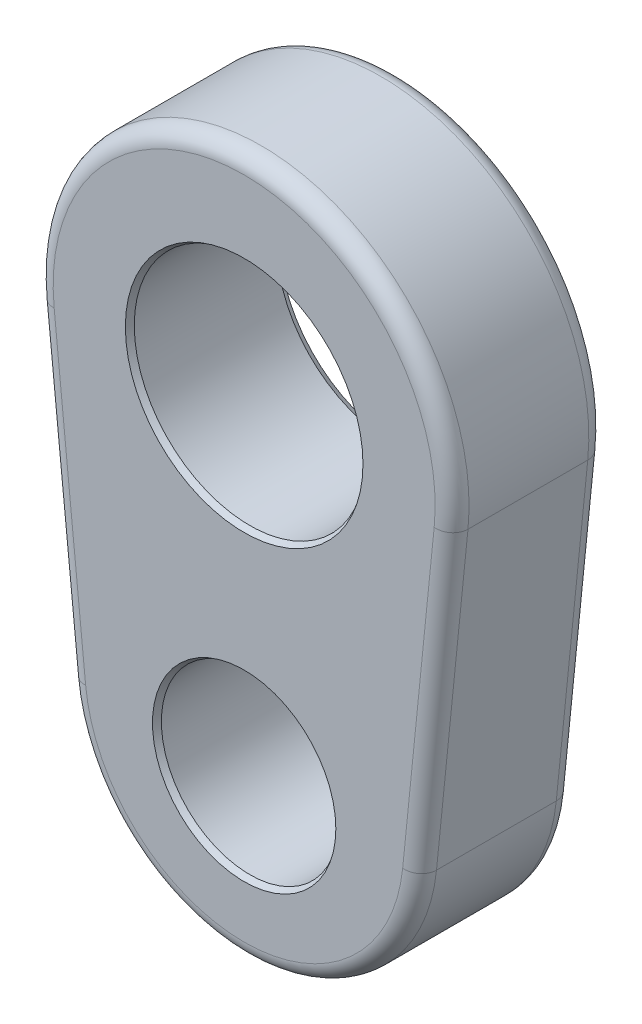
ISO-10303-21;
HEADER;
FILE_DESCRIPTION(('STEP AP214'),'2;1');
FILE_NAME('part.step','',(''),(''),'','','');
FILE_SCHEMA(('AUTOMOTIVE_DESIGN { 1 0 10303 214 1 1 1 1 }'));
ENDSEC;
DATA;
#1=APPLICATION_CONTEXT('core data for automotive mechanical design processes');
#2=APPLICATION_PROTOCOL_DEFINITION('international standard','automotive_design',2000,#1);
#3=PRODUCT_CONTEXT('',#1,'mechanical');
#4=PRODUCT('Part','Part','',(#3));
#5=PRODUCT_RELATED_PRODUCT_CATEGORY('part','',(#4));
#6=PRODUCT_DEFINITION_FORMATION('','',#4);
#7=PRODUCT_DEFINITION_CONTEXT('part definition',#1,'design');
#8=PRODUCT_DEFINITION('design','',#6,#7);
#9=PRODUCT_DEFINITION_SHAPE('','',#8);
#10=(LENGTH_UNIT() NAMED_UNIT(*) SI_UNIT(.MILLI.,.METRE.));
#11=(NAMED_UNIT(*) PLANE_ANGLE_UNIT() SI_UNIT($,.RADIAN.));
#12=(NAMED_UNIT(*) SI_UNIT($,.STERADIAN.) SOLID_ANGLE_UNIT());
#13=UNCERTAINTY_MEASURE_WITH_UNIT(LENGTH_MEASURE(1.E-05),#10,'distance_accuracy_value','');
#14=(GEOMETRIC_REPRESENTATION_CONTEXT(3) GLOBAL_UNCERTAINTY_ASSIGNED_CONTEXT((#13)) GLOBAL_UNIT_ASSIGNED_CONTEXT((#10,
#11,#12)) REPRESENTATION_CONTEXT('',''));
#15=CARTESIAN_POINT('',(0.,0.,0.));
#16=DIRECTION('',(0.,0.,1.));
#17=DIRECTION('',(1.,0.,0.));
#18=AXIS2_PLACEMENT_3D('',#15,#16,#17);
#19=CARTESIAN_POINT('',(0.,-7.0612,1.7272));
#20=DIRECTION('',(0.,0.,1.));
#21=DIRECTION('',(1.,0.,0.));
#22=AXIS2_PLACEMENT_3D('',#19,#20,#21);
#23=PLANE('',#22);
#24=CARTESIAN_POINT('',(0.,-7.0612,1.7272));
#25=DIRECTION('',(0.,0.,1.));
#26=DIRECTION('',(1.,0.,0.));
#27=AXIS2_PLACEMENT_3D('',#24,#25,#26);
#28=CIRCLE('',#27,3.5814);
#29=CARTESIAN_POINT('',(-3.56318811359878,-7.42191654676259,1.7272));
#30=VERTEX_POINT('',#29);
#31=CARTESIAN_POINT('',(3.56318811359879,-7.42191654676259,1.7272));
#32=VERTEX_POINT('',#31);
#33=EDGE_CURVE('E49',#30,#32,#28,.T.);
#34=ORIENTED_EDGE('',*,*,#33,.T.);
#35=DIRECTION('',(0.100719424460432,0.994914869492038,0.));
#36=VECTOR('',#35,1.);
#37=CARTESIAN_POINT('',(4.27077156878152,-0.432348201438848,1.7272));
#38=LINE('',#37,#36);
#39=CARTESIAN_POINT('',(4.27077156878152,-0.432348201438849,1.7272));
#40=VERTEX_POINT('',#39);
#41=EDGE_CURVE('E108',#32,#40,#38,.T.);
#42=ORIENTED_EDGE('',*,*,#41,.T.);
#43=CARTESIAN_POINT('',(0.,0.,1.7272));
#44=DIRECTION('',(0.,0.,1.));
#45=DIRECTION('',(1.,0.,0.));
#46=AXIS2_PLACEMENT_3D('',#43,#44,#45);
#47=CIRCLE('',#46,4.2926);
#48=CARTESIAN_POINT('',(-4.27077156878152,-0.43234820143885,1.7272));
#49=VERTEX_POINT('',#48);
#50=EDGE_CURVE('E132',#40,#49,#47,.T.);
#51=ORIENTED_EDGE('',*,*,#50,.T.);
#52=DIRECTION('',(0.100719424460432,-0.994914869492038,0.));
#53=VECTOR('',#52,1.);
#54=CARTESIAN_POINT('',(-3.56318811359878,-7.42191654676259,1.7272));
#55=LINE('',#54,#53);
#56=EDGE_CURVE('E54',#49,#30,#55,.T.);
#57=ORIENTED_EDGE('',*,*,#56,.T.);
#58=EDGE_LOOP('',(#34,#42,#51,#57));
#59=FACE_BOUND('',#58,.T.);
#60=CARTESIAN_POINT('',(0.,-7.405624,1.7272));
#61=DIRECTION('',(0.,0.,1.));
#62=DIRECTION('',(1.,0.,0.));
#63=AXIS2_PLACEMENT_3D('',#60,#61,#62);
#64=CIRCLE('',#63,2.06087348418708);
#65=CARTESIAN_POINT('',(2.06087348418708,-7.405624,1.7272));
#66=VERTEX_POINT('',#65);
#67=EDGE_CURVE('E173',#66,#66,#64,.F.);
#68=ORIENTED_EDGE('',*,*,#67,.T.);
#69=EDGE_LOOP('',(#68));
#70=FACE_BOUND('',#69,.T.);
#71=CARTESIAN_POINT('',(0.,0.,1.7272));
#72=DIRECTION('',(0.,0.,1.));
#73=DIRECTION('',(1.,0.,0.));
#74=AXIS2_PLACEMENT_3D('',#71,#72,#73);
#75=CIRCLE('',#74,2.67047348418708);
#76=CARTESIAN_POINT('',(2.67047348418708,0.,1.7272));
#77=VERTEX_POINT('',#76);
#78=EDGE_CURVE('E170',#77,#77,#75,.F.);
#79=ORIENTED_EDGE('',*,*,#78,.T.);
#80=EDGE_LOOP('',(#79));
#81=FACE_BOUND('',#80,.T.);
#82=ADVANCED_FACE('F32',(#59,#70,#81),#23,.T.);
#83=CARTESIAN_POINT('',(0.,-7.0612,-1.7272));
#84=DIRECTION('',(0.,0.,1.));
#85=DIRECTION('',(1.,0.,0.));
#86=AXIS2_PLACEMENT_3D('',#83,#84,#85);
#87=PLANE('',#86);
#88=CARTESIAN_POINT('',(0.,0.,-1.7272));
#89=DIRECTION('',(0.,0.,1.));
#90=DIRECTION('',(1.,0.,0.));
#91=AXIS2_PLACEMENT_3D('',#88,#89,#90);
#92=CIRCLE('',#91,4.2926);
#93=CARTESIAN_POINT('',(-4.27077156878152,-0.43234820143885,-1.7272));
#94=VERTEX_POINT('',#93);
#95=CARTESIAN_POINT('',(4.27077156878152,-0.432348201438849,-1.7272));
#96=VERTEX_POINT('',#95);
#97=EDGE_CURVE('E191',#94,#96,#92,.F.);
#98=ORIENTED_EDGE('',*,*,#97,.T.);
#99=DIRECTION('',(0.100719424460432,0.994914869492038,0.));
#100=VECTOR('',#99,1.);
#101=CARTESIAN_POINT('',(3.56318811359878,-7.42191654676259,-1.7272));
#102=LINE('',#101,#100);
#103=CARTESIAN_POINT('',(3.56318811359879,-7.42191654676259,-1.7272));
#104=VERTEX_POINT('',#103);
#105=EDGE_CURVE('E197',#96,#104,#102,.F.);
#106=ORIENTED_EDGE('',*,*,#105,.T.);
#107=CARTESIAN_POINT('',(0.,-7.0612,-1.7272));
#108=DIRECTION('',(0.,0.,1.));
#109=DIRECTION('',(1.,0.,0.));
#110=AXIS2_PLACEMENT_3D('',#107,#108,#109);
#111=CIRCLE('',#110,3.5814);
#112=CARTESIAN_POINT('',(-3.56318811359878,-7.42191654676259,-1.7272));
#113=VERTEX_POINT('',#112);
#114=EDGE_CURVE('E195',#104,#113,#111,.F.);
#115=ORIENTED_EDGE('',*,*,#114,.T.);
#116=DIRECTION('',(0.100719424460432,-0.994914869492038,0.));
#117=VECTOR('',#116,1.);
#118=CARTESIAN_POINT('',(-3.56318811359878,-7.42191654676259,-1.7272));
#119=LINE('',#118,#117);
#120=EDGE_CURVE('E193',#113,#94,#119,.F.);
#121=ORIENTED_EDGE('',*,*,#120,.T.);
#122=EDGE_LOOP('',(#98,#106,#115,#121));
#123=FACE_BOUND('',#122,.T.);
#124=CARTESIAN_POINT('',(0.,-7.405624,-1.7272));
#125=DIRECTION('',(0.,0.,1.));
#126=DIRECTION('',(1.,0.,0.));
#127=AXIS2_PLACEMENT_3D('',#124,#125,#126);
#128=CIRCLE('',#127,2.06087348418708);
#129=CARTESIAN_POINT('',(2.06087348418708,-7.405624,-1.7272));
#130=VERTEX_POINT('',#129);
#131=EDGE_CURVE('E182',#130,#130,#128,.T.);
#132=ORIENTED_EDGE('',*,*,#131,.T.);
#133=EDGE_LOOP('',(#132));
#134=FACE_BOUND('',#133,.T.);
#135=CARTESIAN_POINT('',(0.,0.,-1.7272));
#136=DIRECTION('',(0.,0.,1.));
#137=DIRECTION('',(1.,0.,0.));
#138=AXIS2_PLACEMENT_3D('',#135,#136,#137);
#139=CIRCLE('',#138,2.67047348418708);
#140=CARTESIAN_POINT('',(2.67047348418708,0.,-1.7272));
#141=VERTEX_POINT('',#140);
#142=EDGE_CURVE('E179',#141,#141,#139,.T.);
#143=ORIENTED_EDGE('',*,*,#142,.T.);
#144=EDGE_LOOP('',(#143));
#145=FACE_BOUND('',#144,.T.);
#146=ADVANCED_FACE('F235',(#123,#134,#145),#87,.F.);
#147=CARTESIAN_POINT('',(0.,-7.0612,1.7272));
#148=DIRECTION('',(0.,0.,-1.));
#149=DIRECTION('',(-1.,0.,0.));
#150=AXIS2_PLACEMENT_3D('',#147,#148,#149);
#151=CYLINDRICAL_SURFACE('',#150,3.9624);
#152=DIRECTION('',(0.,0.,-1.));
#153=VECTOR('',#152,1.);
#154=CARTESIAN_POINT('',(-3.94225067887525,-7.46029064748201,1.7272));
#155=LINE('',#154,#153);
#156=CARTESIAN_POINT('',(-3.94225067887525,-7.46029064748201,1.3462));
#157=VERTEX_POINT('',#156);
#158=CARTESIAN_POINT('',(-3.94225067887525,-7.46029064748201,-1.3462));
#159=VERTEX_POINT('',#158);
#160=EDGE_CURVE('E155',#157,#159,#155,.T.);
#161=ORIENTED_EDGE('',*,*,#160,.T.);
#162=CARTESIAN_POINT('',(0.,-7.0612,-1.3462));
#163=DIRECTION('',(0.,0.,1.));
#164=DIRECTION('',(1.,0.,0.));
#165=AXIS2_PLACEMENT_3D('',#162,#163,#164);
#166=CIRCLE('',#165,3.9624);
#167=CARTESIAN_POINT('',(3.94225067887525,-7.46029064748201,-1.3462));
#168=VERTEX_POINT('',#167);
#169=EDGE_CURVE('E202',#159,#168,#166,.T.);
#170=ORIENTED_EDGE('',*,*,#169,.T.);
#171=DIRECTION('',(0.,0.,-1.));
#172=VECTOR('',#171,1.);
#173=CARTESIAN_POINT('',(3.94225067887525,-7.46029064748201,1.7272));
#174=LINE('',#173,#172);
#175=CARTESIAN_POINT('',(3.94225067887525,-7.46029064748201,1.3462));
#176=VERTEX_POINT('',#175);
#177=EDGE_CURVE('E120',#176,#168,#174,.T.);
#178=ORIENTED_EDGE('',*,*,#177,.F.);
#179=CARTESIAN_POINT('',(0.,-7.0612,1.3462));
#180=DIRECTION('',(0.,0.,1.));
#181=DIRECTION('',(1.,0.,0.));
#182=AXIS2_PLACEMENT_3D('',#179,#180,#181);
#183=CIRCLE('',#182,3.9624);
#184=EDGE_CURVE('E200',#176,#157,#183,.F.);
#185=ORIENTED_EDGE('',*,*,#184,.T.);
#186=EDGE_LOOP('',(#161,#170,#178,#185));
#187=FACE_BOUND('',#186,.T.);
#188=ADVANCED_FACE('F215',(#187),#151,.T.);
#189=CARTESIAN_POINT('',(3.94225067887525,-7.46029064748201,1.7272));
#190=DIRECTION('',(-0.994914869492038,0.100719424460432,0.));
#191=DIRECTION('',(-0.100719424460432,-0.994914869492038,0.));
#192=AXIS2_PLACEMENT_3D('',#189,#190,#191);
#193=PLANE('',#192);
#194=ORIENTED_EDGE('',*,*,#177,.T.);
#195=DIRECTION('',(0.100719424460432,0.994914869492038,0.));
#196=VECTOR('',#195,1.);
#197=CARTESIAN_POINT('',(3.94225067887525,-7.46029064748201,-1.3462));
#198=LINE('',#197,#196);
#199=CARTESIAN_POINT('',(4.64983413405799,-0.470722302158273,-1.3462));
#200=VERTEX_POINT('',#199);
#201=EDGE_CURVE('E119',#168,#200,#198,.T.);
#202=ORIENTED_EDGE('',*,*,#201,.T.);
#203=DIRECTION('',(0.,0.,-1.));
#204=VECTOR('',#203,1.);
#205=CARTESIAN_POINT('',(4.64983413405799,-0.470722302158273,1.7272));
#206=LINE('',#205,#204);
#207=CARTESIAN_POINT('',(4.64983413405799,-0.470722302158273,1.3462));
#208=VERTEX_POINT('',#207);
#209=EDGE_CURVE('E101',#208,#200,#206,.T.);
#210=ORIENTED_EDGE('',*,*,#209,.F.);
#211=DIRECTION('',(0.100719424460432,0.994914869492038,0.));
#212=VECTOR('',#211,1.);
#213=CARTESIAN_POINT('',(3.94225067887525,-7.46029064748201,1.3462));
#214=LINE('',#213,#212);
#215=EDGE_CURVE('E116',#208,#176,#214,.F.);
#216=ORIENTED_EDGE('',*,*,#215,.T.);
#217=EDGE_LOOP('',(#194,#202,#210,#216));
#218=FACE_BOUND('',#217,.T.);
#219=ADVANCED_FACE('F115',(#218),#193,.F.);
#220=CARTESIAN_POINT('',(0.,0.,1.7272));
#221=DIRECTION('',(0.,0.,-1.));
#222=DIRECTION('',(-1.,0.,0.));
#223=AXIS2_PLACEMENT_3D('',#220,#221,#222);
#224=CYLINDRICAL_SURFACE('',#223,4.6736);
#225=ORIENTED_EDGE('',*,*,#209,.T.);
#226=CARTESIAN_POINT('',(0.,0.,-1.3462));
#227=DIRECTION('',(0.,0.,1.));
#228=DIRECTION('',(1.,0.,0.));
#229=AXIS2_PLACEMENT_3D('',#226,#227,#228);
#230=CIRCLE('',#229,4.6736);
#231=CARTESIAN_POINT('',(-4.64983413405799,-0.470722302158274,-1.3462));
#232=VERTEX_POINT('',#231);
#233=EDGE_CURVE('E11',#200,#232,#230,.T.);
#234=ORIENTED_EDGE('',*,*,#233,.T.);
#235=DIRECTION('',(0.,0.,-1.));
#236=VECTOR('',#235,1.);
#237=CARTESIAN_POINT('',(-4.64983413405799,-0.470722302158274,1.7272));
#238=LINE('',#237,#236);
#239=CARTESIAN_POINT('',(-4.64983413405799,-0.470722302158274,1.3462));
#240=VERTEX_POINT('',#239);
#241=EDGE_CURVE('E103',#240,#232,#238,.T.);
#242=ORIENTED_EDGE('',*,*,#241,.F.);
#243=CARTESIAN_POINT('',(0.,0.,1.3462));
#244=DIRECTION('',(0.,0.,1.));
#245=DIRECTION('',(1.,0.,0.));
#246=AXIS2_PLACEMENT_3D('',#243,#244,#245);
#247=CIRCLE('',#246,4.6736);
#248=EDGE_CURVE('E41',#240,#208,#247,.F.);
#249=ORIENTED_EDGE('',*,*,#248,.T.);
#250=EDGE_LOOP('',(#225,#234,#242,#249));
#251=FACE_BOUND('',#250,.T.);
#252=ADVANCED_FACE('F100',(#251),#224,.T.);
#253=CARTESIAN_POINT('',(-3.94225067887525,-7.46029064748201,1.7272));
#254=DIRECTION('',(0.994914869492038,0.100719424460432,0.));
#255=DIRECTION('',(-0.100719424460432,0.994914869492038,0.));
#256=AXIS2_PLACEMENT_3D('',#253,#254,#255);
#257=PLANE('',#256);
#258=ORIENTED_EDGE('',*,*,#241,.T.);
#259=DIRECTION('',(0.100719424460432,-0.994914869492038,0.));
#260=VECTOR('',#259,1.);
#261=CARTESIAN_POINT('',(-3.94225067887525,-7.46029064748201,-1.3462));
#262=LINE('',#261,#260);
#263=EDGE_CURVE('E206',#232,#159,#262,.T.);
#264=ORIENTED_EDGE('',*,*,#263,.T.);
#265=ORIENTED_EDGE('',*,*,#160,.F.);
#266=DIRECTION('',(0.100719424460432,-0.994914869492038,0.));
#267=VECTOR('',#266,1.);
#268=CARTESIAN_POINT('',(-4.64983413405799,-0.470722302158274,1.3462));
#269=LINE('',#268,#267);
#270=EDGE_CURVE('E204',#157,#240,#269,.F.);
#271=ORIENTED_EDGE('',*,*,#270,.T.);
#272=EDGE_LOOP('',(#258,#264,#265,#271));
#273=FACE_BOUND('',#272,.T.);
#274=ADVANCED_FACE('F217',(#273),#257,.F.);
#275=CARTESIAN_POINT('',(0.,0.,1.7272));
#276=DIRECTION('',(0.,0.,-1.));
#277=DIRECTION('',(-1.,0.,0.));
#278=AXIS2_PLACEMENT_3D('',#275,#276,#277);
#279=CYLINDRICAL_SURFACE('',#278,2.59715);
#280=CARTESIAN_POINT('',(0.,0.,-1.6002));
#281=DIRECTION('',(0.,0.,1.));
#282=DIRECTION('',(1.,0.,0.));
#283=AXIS2_PLACEMENT_3D('',#280,#281,#282);
#284=CIRCLE('',#283,2.59715);
#285=CARTESIAN_POINT('',(2.59715,0.,-1.6002));
#286=VERTEX_POINT('',#285);
#287=EDGE_CURVE('E129',#286,#286,#284,.F.);
#288=ORIENTED_EDGE('',*,*,#287,.T.);
#289=EDGE_LOOP('',(#288));
#290=FACE_BOUND('',#289,.T.);
#291=CARTESIAN_POINT('',(0.,0.,1.6002));
#292=DIRECTION('',(0.,0.,1.));
#293=DIRECTION('',(1.,0.,0.));
#294=AXIS2_PLACEMENT_3D('',#291,#292,#293);
#295=CIRCLE('',#294,2.59715);
#296=CARTESIAN_POINT('',(2.59715,0.,1.6002));
#297=VERTEX_POINT('',#296);
#298=EDGE_CURVE('E176',#297,#297,#295,.T.);
#299=ORIENTED_EDGE('',*,*,#298,.T.);
#300=EDGE_LOOP('',(#299));
#301=FACE_BOUND('',#300,.T.);
#302=ADVANCED_FACE('F243',(#290,#301),#279,.F.);
#303=CARTESIAN_POINT('',(0.,-7.405624,1.7272));
#304=DIRECTION('',(0.,0.,-1.));
#305=DIRECTION('',(-1.,0.,0.));
#306=AXIS2_PLACEMENT_3D('',#303,#304,#305);
#307=CYLINDRICAL_SURFACE('',#306,1.98755);
#308=CARTESIAN_POINT('',(0.,-7.405624,-1.6002));
#309=DIRECTION('',(0.,0.,1.));
#310=DIRECTION('',(1.,0.,0.));
#311=AXIS2_PLACEMENT_3D('',#308,#309,#310);
#312=CIRCLE('',#311,1.98755);
#313=CARTESIAN_POINT('',(1.98755,-7.405624,-1.6002));
#314=VERTEX_POINT('',#313);
#315=EDGE_CURVE('E185',#314,#314,#312,.F.);
#316=ORIENTED_EDGE('',*,*,#315,.T.);
#317=EDGE_LOOP('',(#316));
#318=FACE_BOUND('',#317,.T.);
#319=CARTESIAN_POINT('',(0.,-7.405624,1.6002));
#320=DIRECTION('',(0.,0.,1.));
#321=DIRECTION('',(1.,0.,0.));
#322=AXIS2_PLACEMENT_3D('',#319,#320,#321);
#323=CIRCLE('',#322,1.98755);
#324=CARTESIAN_POINT('',(1.98755,-7.405624,1.6002));
#325=VERTEX_POINT('',#324);
#326=EDGE_CURVE('E167',#325,#325,#323,.T.);
#327=ORIENTED_EDGE('',*,*,#326,.T.);
#328=EDGE_LOOP('',(#327));
#329=FACE_BOUND('',#328,.T.);
#330=ADVANCED_FACE('F258',(#318,#329),#307,.F.);
#331=CARTESIAN_POINT('',(0.,-7.405624,1.6002));
#332=DIRECTION('',(0.,0.,1.));
#333=DIRECTION('',(1.,0.,0.));
#334=AXIS2_PLACEMENT_3D('',#331,#332,#333);
#335=CONICAL_SURFACE('',#334,1.98755,0.523598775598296);
#336=ORIENTED_EDGE('',*,*,#67,.F.);
#337=EDGE_LOOP('',(#336));
#338=FACE_BOUND('',#337,.T.);
#339=ORIENTED_EDGE('',*,*,#326,.F.);
#340=EDGE_LOOP('',(#339));
#341=FACE_BOUND('',#340,.T.);
#342=ADVANCED_FACE('F254',(#338,#341),#335,.F.);
#343=CARTESIAN_POINT('',(0.,0.,1.6002));
#344=DIRECTION('',(0.,0.,1.));
#345=DIRECTION('',(1.,0.,0.));
#346=AXIS2_PLACEMENT_3D('',#343,#344,#345);
#347=CONICAL_SURFACE('',#346,2.59715,0.523598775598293);
#348=ORIENTED_EDGE('',*,*,#78,.F.);
#349=EDGE_LOOP('',(#348));
#350=FACE_BOUND('',#349,.T.);
#351=ORIENTED_EDGE('',*,*,#298,.F.);
#352=EDGE_LOOP('',(#351));
#353=FACE_BOUND('',#352,.T.);
#354=ADVANCED_FACE('F257',(#350,#353),#347,.F.);
#355=CARTESIAN_POINT('',(0.,-7.405624,-1.7272));
#356=DIRECTION('',(0.,0.,-1.));
#357=DIRECTION('',(-1.,0.,0.));
#358=AXIS2_PLACEMENT_3D('',#355,#356,#357);
#359=CONICAL_SURFACE('',#358,2.06087348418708,0.523598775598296);
#360=ORIENTED_EDGE('',*,*,#315,.F.);
#361=EDGE_LOOP('',(#360));
#362=FACE_BOUND('',#361,.T.);
#363=ORIENTED_EDGE('',*,*,#131,.F.);
#364=EDGE_LOOP('',(#363));
#365=FACE_BOUND('',#364,.T.);
#366=ADVANCED_FACE('F262',(#362,#365),#359,.F.);
#367=CARTESIAN_POINT('',(0.,0.,-1.7272));
#368=DIRECTION('',(0.,0.,-1.));
#369=DIRECTION('',(-1.,0.,0.));
#370=AXIS2_PLACEMENT_3D('',#367,#368,#369);
#371=CONICAL_SURFACE('',#370,2.67047348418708,0.523598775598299);
#372=ORIENTED_EDGE('',*,*,#287,.F.);
#373=EDGE_LOOP('',(#372));
#374=FACE_BOUND('',#373,.T.);
#375=ORIENTED_EDGE('',*,*,#142,.F.);
#376=EDGE_LOOP('',(#375));
#377=FACE_BOUND('',#376,.T.);
#378=ADVANCED_FACE('F265',(#374,#377),#371,.F.);
#379=CARTESIAN_POINT('',(-3.56318811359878,-7.42191654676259,-1.3462));
#380=DIRECTION('',(0.100719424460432,-0.994914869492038,0.));
#381=DIRECTION('',(0.994914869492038,0.100719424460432,0.));
#382=AXIS2_PLACEMENT_3D('',#379,#380,#381);
#383=CYLINDRICAL_SURFACE('',#382,0.381);
#384=CARTESIAN_POINT('',(-4.27077156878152,-0.43234820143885,-1.3462));
#385=DIRECTION('',(-0.100719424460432,0.994914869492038,0.));
#386=DIRECTION('',(-0.994914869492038,-0.100719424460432,0.));
#387=AXIS2_PLACEMENT_3D('',#384,#385,#386);
#388=CIRCLE('',#387,0.381);
#389=EDGE_CURVE('E148',#94,#232,#388,.T.);
#390=ORIENTED_EDGE('',*,*,#389,.F.);
#391=ORIENTED_EDGE('',*,*,#120,.F.);
#392=CARTESIAN_POINT('',(-3.56318811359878,-7.42191654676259,-1.3462));
#393=DIRECTION('',(0.100719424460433,-0.994914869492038,0.));
#394=DIRECTION('',(0.994914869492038,0.100719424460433,0.));
#395=AXIS2_PLACEMENT_3D('',#392,#393,#394);
#396=CIRCLE('',#395,0.381);
#397=EDGE_CURVE('E137',#159,#113,#396,.T.);
#398=ORIENTED_EDGE('',*,*,#397,.F.);
#399=ORIENTED_EDGE('',*,*,#263,.F.);
#400=EDGE_LOOP('',(#390,#391,#398,#399));
#401=FACE_BOUND('',#400,.T.);
#402=ADVANCED_FACE('F220',(#401),#383,.T.);
#403=CARTESIAN_POINT('',(0.,-7.0612,-1.3462));
#404=DIRECTION('',(0.,0.,1.));
#405=DIRECTION('',(1.,0.,0.));
#406=AXIS2_PLACEMENT_3D('',#403,#404,#405);
#407=TOROIDAL_SURFACE('',#406,3.5814,0.381);
#408=ORIENTED_EDGE('',*,*,#397,.T.);
#409=ORIENTED_EDGE('',*,*,#114,.F.);
#410=CARTESIAN_POINT('',(3.56318811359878,-7.42191654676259,-1.3462));
#411=DIRECTION('',(0.100719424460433,0.994914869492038,0.));
#412=DIRECTION('',(-0.994914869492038,0.100719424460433,0.));
#413=AXIS2_PLACEMENT_3D('',#410,#411,#412);
#414=CIRCLE('',#413,0.381);
#415=EDGE_CURVE('E142',#168,#104,#414,.T.);
#416=ORIENTED_EDGE('',*,*,#415,.F.);
#417=ORIENTED_EDGE('',*,*,#169,.F.);
#418=EDGE_LOOP('',(#408,#409,#416,#417));
#419=FACE_BOUND('',#418,.T.);
#420=ADVANCED_FACE('F223',(#419),#407,.T.);
#421=CARTESIAN_POINT('',(0.,0.,-1.3462));
#422=DIRECTION('',(0.,0.,1.));
#423=DIRECTION('',(1.,0.,0.));
#424=AXIS2_PLACEMENT_3D('',#421,#422,#423);
#425=TOROIDAL_SURFACE('',#424,4.2926,0.381);
#426=ORIENTED_EDGE('',*,*,#389,.T.);
#427=ORIENTED_EDGE('',*,*,#233,.F.);
#428=CARTESIAN_POINT('',(4.27077156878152,-0.432348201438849,-1.3462));
#429=DIRECTION('',(-0.100719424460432,-0.994914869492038,0.));
#430=DIRECTION('',(0.994914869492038,-0.100719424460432,0.));
#431=AXIS2_PLACEMENT_3D('',#428,#429,#430);
#432=CIRCLE('',#431,0.381);
#433=EDGE_CURVE('E140',#96,#200,#432,.T.);
#434=ORIENTED_EDGE('',*,*,#433,.F.);
#435=ORIENTED_EDGE('',*,*,#97,.F.);
#436=EDGE_LOOP('',(#426,#427,#434,#435));
#437=FACE_BOUND('',#436,.T.);
#438=ADVANCED_FACE('F226',(#437),#425,.T.);
#439=CARTESIAN_POINT('',(3.56318811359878,-7.42191654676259,-1.3462));
#440=DIRECTION('',(0.100719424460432,0.994914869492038,0.));
#441=DIRECTION('',(-0.994914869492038,0.100719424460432,0.));
#442=AXIS2_PLACEMENT_3D('',#439,#440,#441);
#443=CYLINDRICAL_SURFACE('',#442,0.381);
#444=ORIENTED_EDGE('',*,*,#415,.T.);
#445=ORIENTED_EDGE('',*,*,#105,.F.);
#446=ORIENTED_EDGE('',*,*,#433,.T.);
#447=ORIENTED_EDGE('',*,*,#201,.F.);
#448=EDGE_LOOP('',(#444,#445,#446,#447));
#449=FACE_BOUND('',#448,.T.);
#450=ADVANCED_FACE('F224',(#449),#443,.T.);
#451=CARTESIAN_POINT('',(-3.56318811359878,-7.42191654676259,1.3462));
#452=DIRECTION('',(-0.100719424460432,0.994914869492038,0.));
#453=DIRECTION('',(-0.994914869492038,-0.100719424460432,0.));
#454=AXIS2_PLACEMENT_3D('',#451,#452,#453);
#455=CYLINDRICAL_SURFACE('',#454,0.381);
#456=CARTESIAN_POINT('',(-4.27077156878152,-0.43234820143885,1.3462));
#457=DIRECTION('',(-0.100719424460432,0.994914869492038,0.));
#458=DIRECTION('',(-0.994914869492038,-0.100719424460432,0.));
#459=AXIS2_PLACEMENT_3D('',#456,#457,#458);
#460=CIRCLE('',#459,0.381);
#461=EDGE_CURVE('E134',#240,#49,#460,.T.);
#462=ORIENTED_EDGE('',*,*,#461,.F.);
#463=ORIENTED_EDGE('',*,*,#270,.F.);
#464=CARTESIAN_POINT('',(-3.56318811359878,-7.42191654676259,1.3462));
#465=DIRECTION('',(0.100719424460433,-0.994914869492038,0.));
#466=DIRECTION('',(0.994914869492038,0.100719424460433,0.));
#467=AXIS2_PLACEMENT_3D('',#464,#465,#466);
#468=CIRCLE('',#467,0.381);
#469=EDGE_CURVE('E36',#30,#157,#468,.T.);
#470=ORIENTED_EDGE('',*,*,#469,.F.);
#471=ORIENTED_EDGE('',*,*,#56,.F.);
#472=EDGE_LOOP('',(#462,#463,#470,#471));
#473=FACE_BOUND('',#472,.T.);
#474=ADVANCED_FACE('F34',(#473),#455,.T.);
#475=CARTESIAN_POINT('',(0.,-7.0612,1.3462));
#476=DIRECTION('',(0.,0.,1.));
#477=DIRECTION('',(1.,0.,0.));
#478=AXIS2_PLACEMENT_3D('',#475,#476,#477);
#479=TOROIDAL_SURFACE('',#478,3.5814,0.381);
#480=ORIENTED_EDGE('',*,*,#469,.T.);
#481=ORIENTED_EDGE('',*,*,#184,.F.);
#482=CARTESIAN_POINT('',(3.56318811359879,-7.42191654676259,1.3462));
#483=DIRECTION('',(0.100719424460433,0.994914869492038,0.));
#484=DIRECTION('',(-0.994914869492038,0.100719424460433,0.));
#485=AXIS2_PLACEMENT_3D('',#482,#483,#484);
#486=CIRCLE('',#485,0.381);
#487=EDGE_CURVE('E127',#32,#176,#486,.T.);
#488=ORIENTED_EDGE('',*,*,#487,.F.);
#489=ORIENTED_EDGE('',*,*,#33,.F.);
#490=EDGE_LOOP('',(#480,#481,#488,#489));
#491=FACE_BOUND('',#490,.T.);
#492=ADVANCED_FACE('F214',(#491),#479,.T.);
#493=CARTESIAN_POINT('',(0.,0.,1.3462));
#494=DIRECTION('',(0.,0.,1.));
#495=DIRECTION('',(1.,0.,0.));
#496=AXIS2_PLACEMENT_3D('',#493,#494,#495);
#497=TOROIDAL_SURFACE('',#496,4.2926,0.381);
#498=ORIENTED_EDGE('',*,*,#461,.T.);
#499=ORIENTED_EDGE('',*,*,#50,.F.);
#500=CARTESIAN_POINT('',(4.27077156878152,-0.432348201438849,1.3462));
#501=DIRECTION('',(-0.100719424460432,-0.994914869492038,0.));
#502=DIRECTION('',(0.994914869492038,-0.100719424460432,0.));
#503=AXIS2_PLACEMENT_3D('',#500,#501,#502);
#504=CIRCLE('',#503,0.381);
#505=EDGE_CURVE('E125',#208,#40,#504,.T.);
#506=ORIENTED_EDGE('',*,*,#505,.F.);
#507=ORIENTED_EDGE('',*,*,#248,.F.);
#508=EDGE_LOOP('',(#498,#499,#506,#507));
#509=FACE_BOUND('',#508,.T.);
#510=ADVANCED_FACE('F131',(#509),#497,.T.);
#511=CARTESIAN_POINT('',(3.56318811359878,-7.42191654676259,1.3462));
#512=DIRECTION('',(-0.100719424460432,-0.994914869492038,0.));
#513=DIRECTION('',(0.994914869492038,-0.100719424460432,0.));
#514=AXIS2_PLACEMENT_3D('',#511,#512,#513);
#515=CYLINDRICAL_SURFACE('',#514,0.381);
#516=ORIENTED_EDGE('',*,*,#487,.T.);
#517=ORIENTED_EDGE('',*,*,#215,.F.);
#518=ORIENTED_EDGE('',*,*,#505,.T.);
#519=ORIENTED_EDGE('',*,*,#41,.F.);
#520=EDGE_LOOP('',(#516,#517,#518,#519));
#521=FACE_BOUND('',#520,.T.);
#522=ADVANCED_FACE('F123',(#521),#515,.T.);
#523=CLOSED_SHELL('',(#82,#146,#188,#219,#252,#274,#302,#330,#342,#354,#366,#378,#402,#420,#438,
#450,#474,#492,#510,#522));
#524=MANIFOLD_SOLID_BREP('B2',#523);
#525=ADVANCED_BREP_SHAPE_REPRESENTATION('',(#18,#524),#14);
#526=SHAPE_DEFINITION_REPRESENTATION(#9,#525);
ENDSEC;
END-ISO-10303-21;
